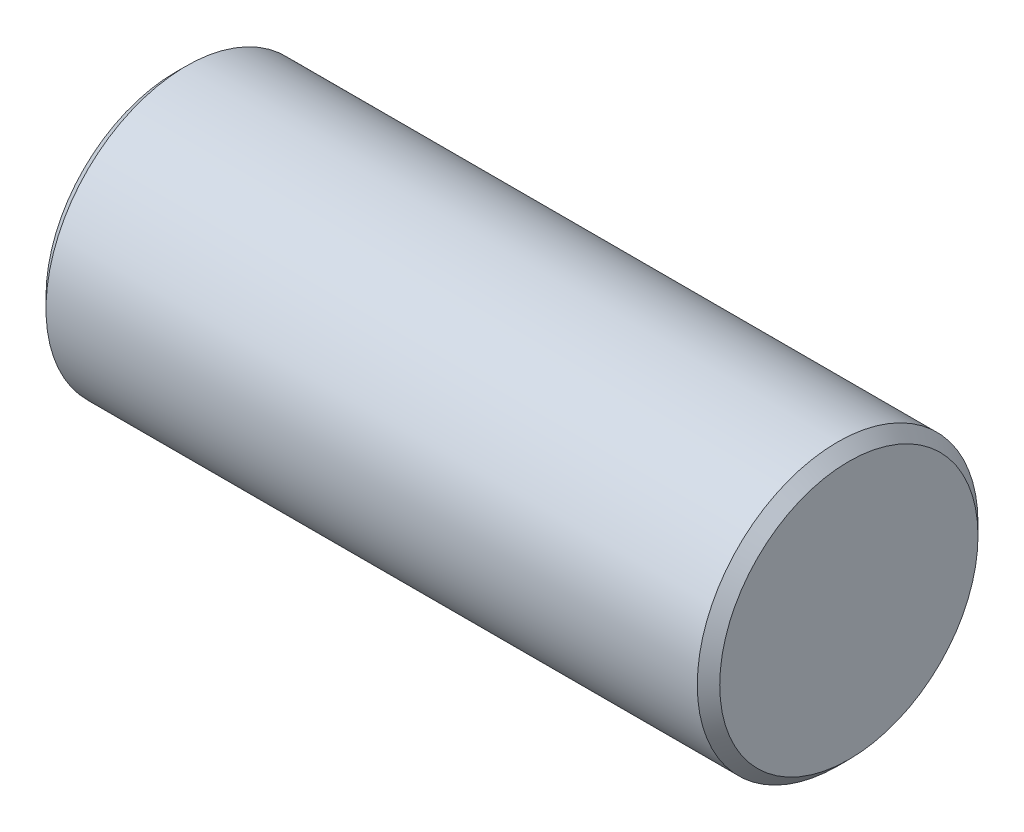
ISO-10303-21;
HEADER;
FILE_DESCRIPTION(('STEP AP214'),'2;1');
FILE_NAME('part.step','',(''),(''),'','','');
FILE_SCHEMA(('AUTOMOTIVE_DESIGN { 1 0 10303 214 1 1 1 1 }'));
ENDSEC;
DATA;
#1=APPLICATION_CONTEXT('core data for automotive mechanical design processes');
#2=APPLICATION_PROTOCOL_DEFINITION('international standard','automotive_design',2000,#1);
#3=PRODUCT_CONTEXT('',#1,'mechanical');
#4=PRODUCT('Part','Part','',(#3));
#5=PRODUCT_RELATED_PRODUCT_CATEGORY('part','',(#4));
#6=PRODUCT_DEFINITION_FORMATION('','',#4);
#7=PRODUCT_DEFINITION_CONTEXT('part definition',#1,'design');
#8=PRODUCT_DEFINITION('design','',#6,#7);
#9=PRODUCT_DEFINITION_SHAPE('','',#8);
#10=(LENGTH_UNIT() NAMED_UNIT(*) SI_UNIT(.MILLI.,.METRE.));
#11=(NAMED_UNIT(*) PLANE_ANGLE_UNIT() SI_UNIT($,.RADIAN.));
#12=(NAMED_UNIT(*) SI_UNIT($,.STERADIAN.) SOLID_ANGLE_UNIT());
#13=UNCERTAINTY_MEASURE_WITH_UNIT(LENGTH_MEASURE(1.E-05),#10,'distance_accuracy_value','');
#14=(GEOMETRIC_REPRESENTATION_CONTEXT(3) GLOBAL_UNCERTAINTY_ASSIGNED_CONTEXT((#13)) GLOBAL_UNIT_ASSIGNED_CONTEXT((#10,
#11,#12)) REPRESENTATION_CONTEXT('',''));
#15=CARTESIAN_POINT('',(0.,0.,0.));
#16=DIRECTION('',(0.,0.,1.));
#17=DIRECTION('',(1.,0.,0.));
#18=AXIS2_PLACEMENT_3D('',#15,#16,#17);
#19=CARTESIAN_POINT('',(0.,0.,0.));
#20=DIRECTION('',(1.,0.,0.));
#21=DIRECTION('',(0.,0.,-1.));
#22=AXIS2_PLACEMENT_3D('',#19,#20,#21);
#23=PLANE('',#22);
#24=CARTESIAN_POINT('',(-5.6843418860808E-11,0.,0.));
#25=DIRECTION('',(1.,0.,0.));
#26=DIRECTION('',(0.,0.,-1.));
#27=AXIS2_PLACEMENT_3D('',#24,#25,#26);
#28=CIRCLE('',#27,2.29999999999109);
#29=CARTESIAN_POINT('',(-5.6843418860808E-11,0.,-2.29999999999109));
#30=VERTEX_POINT('',#29);
#31=EDGE_CURVE('E17',#30,#30,#28,.T.);
#32=ORIENTED_EDGE('',*,*,#31,.F.);
#33=EDGE_LOOP('',(#32));
#34=FACE_BOUND('',#33,.T.);
#35=ADVANCED_FACE('F14',(#34),#23,.F.);
#36=CARTESIAN_POINT('',(12.,0.,0.));
#37=DIRECTION('',(1.,0.,0.));
#38=DIRECTION('',(0.,0.,-1.));
#39=AXIS2_PLACEMENT_3D('',#36,#37,#38);
#40=PLANE('',#39);
#41=CARTESIAN_POINT('',(12.0000000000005,0.,0.));
#42=DIRECTION('',(-1.,0.,0.));
#43=DIRECTION('',(0.,0.,1.));
#44=AXIS2_PLACEMENT_3D('',#41,#42,#43);
#45=CIRCLE('',#44,2.29999999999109);
#46=CARTESIAN_POINT('',(12.0000000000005,0.,2.29999999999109));
#47=VERTEX_POINT('',#46);
#48=EDGE_CURVE('E26',#47,#47,#45,.T.);
#49=ORIENTED_EDGE('',*,*,#48,.F.);
#50=EDGE_LOOP('',(#49));
#51=FACE_BOUND('',#50,.T.);
#52=ADVANCED_FACE('F37',(#51),#40,.T.);
#53=CARTESIAN_POINT('',(0.200000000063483,0.,0.));
#54=DIRECTION('',(1.,0.,0.));
#55=DIRECTION('',(0.,0.,-1.));
#56=AXIS2_PLACEMENT_3D('',#53,#54,#55);
#57=CONICAL_SURFACE('',#56,2.50000000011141,0.785398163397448);
#58=CARTESIAN_POINT('',(0.200000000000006,0.,0.));
#59=DIRECTION('',(1.,0.,0.));
#60=DIRECTION('',(0.,0.,-1.));
#61=AXIS2_PLACEMENT_3D('',#58,#59,#60);
#62=CIRCLE('',#61,2.5);
#63=CARTESIAN_POINT('',(0.200000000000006,0.,-2.5));
#64=VERTEX_POINT('',#63);
#65=EDGE_CURVE('E21',#64,#64,#62,.T.);
#66=ORIENTED_EDGE('',*,*,#65,.F.);
#67=EDGE_LOOP('',(#66));
#68=FACE_BOUND('',#67,.T.);
#69=ORIENTED_EDGE('',*,*,#31,.T.);
#70=EDGE_LOOP('',(#69));
#71=FACE_BOUND('',#70,.T.);
#72=ADVANCED_FACE('F34',(#68,#71),#57,.T.);
#73=CARTESIAN_POINT('',(11.8000000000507,0.,0.));
#74=DIRECTION('',(-1.,0.,0.));
#75=DIRECTION('',(0.,0.,1.));
#76=AXIS2_PLACEMENT_3D('',#73,#74,#75);
#77=CONICAL_SURFACE('',#76,2.49999999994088,0.785398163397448);
#78=CARTESIAN_POINT('',(11.8,0.,0.));
#79=DIRECTION('',(1.,0.,0.));
#80=DIRECTION('',(0.,0.,-1.));
#81=AXIS2_PLACEMENT_3D('',#78,#79,#80);
#82=CIRCLE('',#81,2.5);
#83=CARTESIAN_POINT('',(11.8,0.,-2.5));
#84=VERTEX_POINT('',#83);
#85=EDGE_CURVE('E10',#84,#84,#82,.F.);
#86=ORIENTED_EDGE('',*,*,#85,.F.);
#87=EDGE_LOOP('',(#86));
#88=FACE_BOUND('',#87,.T.);
#89=ORIENTED_EDGE('',*,*,#48,.T.);
#90=EDGE_LOOP('',(#89));
#91=FACE_BOUND('',#90,.T.);
#92=ADVANCED_FACE('F45',(#88,#91),#77,.T.);
#93=CARTESIAN_POINT('',(-0.600000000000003,0.,0.));
#94=DIRECTION('',(1.,0.,0.));
#95=DIRECTION('',(0.,0.,-1.));
#96=AXIS2_PLACEMENT_3D('',#93,#94,#95);
#97=CYLINDRICAL_SURFACE('',#96,2.5);
#98=ORIENTED_EDGE('',*,*,#85,.T.);
#99=EDGE_LOOP('',(#98));
#100=FACE_BOUND('',#99,.T.);
#101=ORIENTED_EDGE('',*,*,#65,.T.);
#102=EDGE_LOOP('',(#101));
#103=FACE_BOUND('',#102,.T.);
#104=ADVANCED_FACE('F43',(#100,#103),#97,.T.);
#105=CLOSED_SHELL('',(#35,#52,#72,#92,#104));
#106=MANIFOLD_SOLID_BREP('B1',#105);
#107=ADVANCED_BREP_SHAPE_REPRESENTATION('',(#18,#106),#14);
#108=SHAPE_DEFINITION_REPRESENTATION(#9,#107);
ENDSEC;
END-ISO-10303-21;
